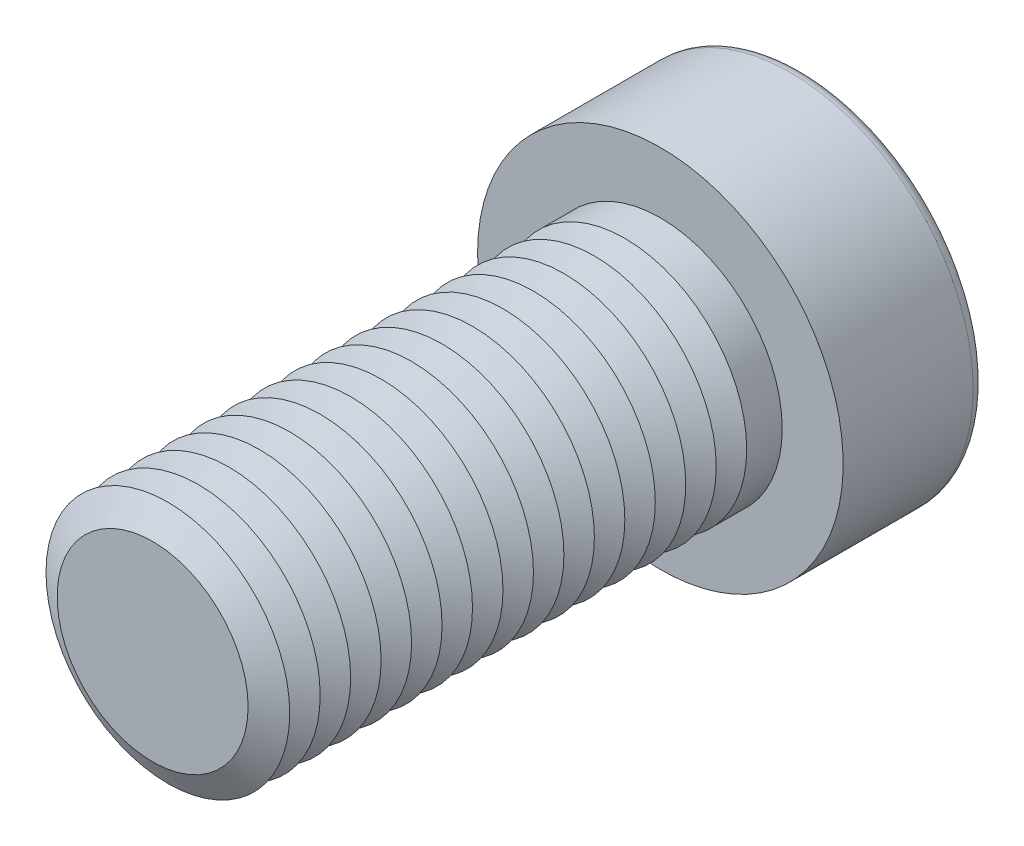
from build123d import *

# Parameters (mm, degrees)
SKETCH1_R           = 12
BOSS_EXTRUDE1_DEPTH = 50
SKETCH2_R           = 18
BOSS_EXTRUDE2_DEPTH = 14
CUT_EXTRUDE1_DEPTH  = 14.25
FILLET1_R           = 1.2
LPATTERN1_COUNT     = 16
LPATTERN1_PITCH     = 3


with BuildPart() as part:
    # Sketch1 → Boss-Extrude1 (new body)
    with BuildSketch(Plane.XY):
        Circle(SKETCH1_R)
    extrude(amount=BOSS_EXTRUDE1_DEPTH)

    # Sketch2 → Boss-Extrude2 (add)
    with BuildSketch(Plane(origin=(0, 0, 0), x_dir=(-1, 0, 0), z_dir=(0, 0, -1))):
        Circle(SKETCH2_R)
    extrude(amount=BOSS_EXTRUDE2_DEPTH)

    # Sketch3 → Cut-Extrude1 (cut)
    with BuildSketch(Plane(origin=(0, 0, -14), x_dir=(-1, 0, 0), z_dir=(0, 0, -1))):
        Polygon((-5.484827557, 9.5), (-10.969655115, 0), (-5.484827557, -9.5), (5.484827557, -9.5), (10.969655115, 0), (5.484827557, 9.5), align=None)
    extrude(amount=-CUT_EXTRUDE1_DEPTH, mode=Mode.SUBTRACT)

    # Fillet1
    fillet1_edges = [part.edges().sort_by_distance(p)[0] for p in [
        (18, 0, -14),
    ]]
    fillet(fillet1_edges, radius=FILLET1_R)

    # Cut-Extrude2 cone 1 section (on through the dimple's axis) → Cut-Extrude2 (revolve, cut)
    with BuildSketch(Plane(origin=(0, 0, 0.25), x_dir=(0, 1, 0), z_dir=(1, 0, 0))):
        Polygon((0, 0), (9.5, 0), (0, 5.484827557), align=None)
    revolve(axis=Axis((0, 0, 0.25), (0, 0, 1)), mode=Mode.SUBTRACT)

    # Cut-Extrude3 cone 1 section (on through the dimple's axis) → Cut-Extrude3 (revolve, cut)
    with BuildSketch(Plane(origin=(0, 0, -14), x_dir=(0, 1, 0), z_dir=(1, 0, 0))):
        Polygon((0, 0), (10.969655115, 0), (0, 2.939310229), align=None)
    revolve(axis=Axis((0, 0, -14), (0, 0, 1)), mode=Mode.SUBTRACT)

    # Sketch7 → Cut-Revolve1 (revolve, cut)
    with BuildSketch(Plane(origin=(0, 0, 0), x_dir=(0, 0, -1), z_dir=(1, 0, 0)), mode=Mode.PRIVATE) as cut_revolve1_sk:
        Polygon((-50, 9.401923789), (-48.5, 12), (-51.5, 12), align=None)
    cut_revolve1 = revolve(cut_revolve1_sk.sketch.rotate(Axis((0, 0, 50), (0, 0, -1)), 90), axis=Axis((0, 0, 50), (0, 0, -1)), mode=Mode.SUBTRACT)

    # LPattern1: Cut-Revolve1 ×16
    with Locations(*[(0, 0, -i * LPATTERN1_PITCH) for i in range(1, LPATTERN1_COUNT)]):
        add(cut_revolve1, mode=Mode.SUBTRACT)


solid = part.part
